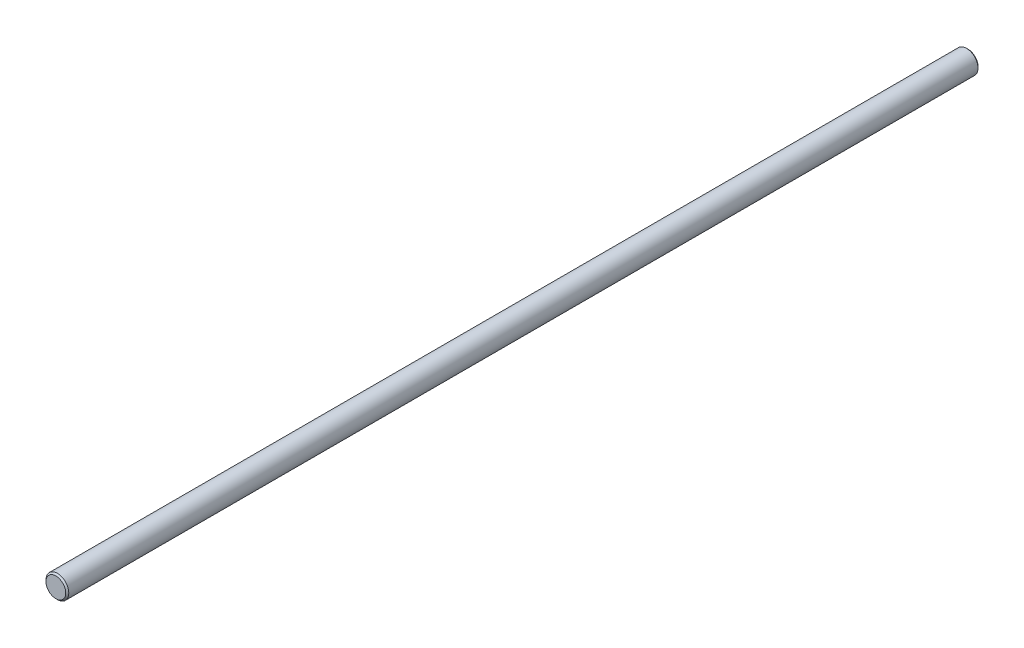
from build123d import *

# Parameters (mm, degrees)
ESQUISSE1_R      = 1.5
EXTRUSION1_DEPTH = 120
CHANFREIN1_SIZE  = 0.2


with BuildPart() as part:
    # Esquisse1 → Extrusion1 (new body)
    with BuildSketch(Plane.XY):
        Circle(ESQUISSE1_R)
    extrude(amount=EXTRUSION1_DEPTH)

    # Chanfrein1
    chanfrein1_edges = [part.edges().sort_by_distance(p)[0] for p in [
        (-1.5, 0, 0),
        (-1.5, 0, 120),
    ]]
    chamfer(chanfrein1_edges, length=CHANFREIN1_SIZE)


solid = part.part
